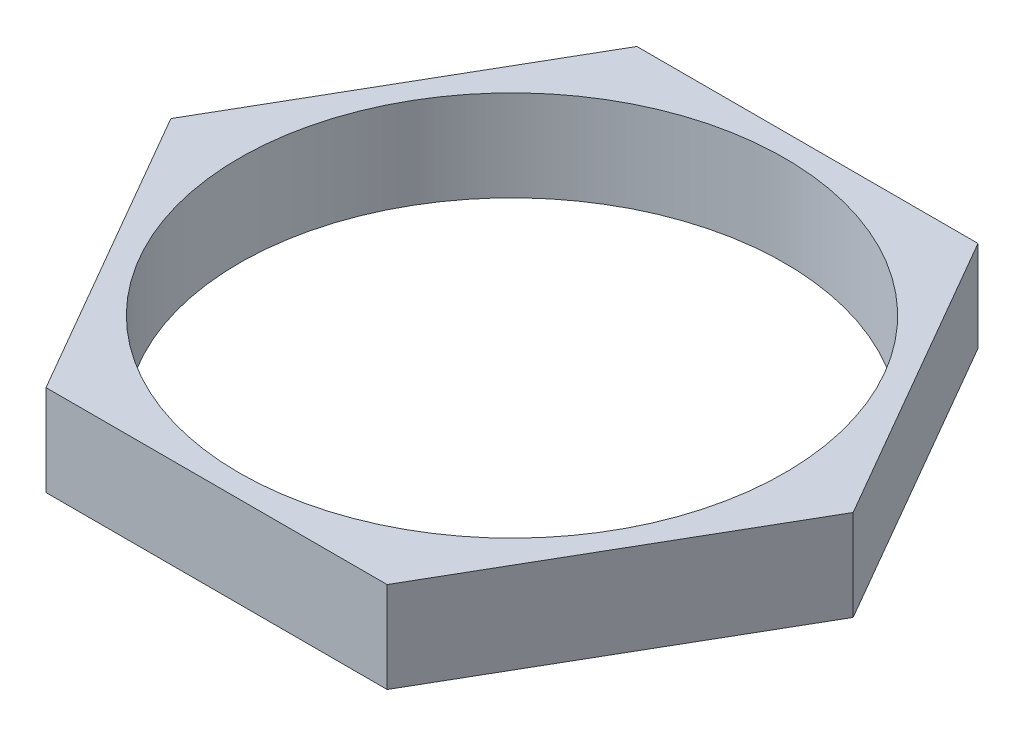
from build123d import *

# Parameters (mm, degrees)
ESQUISSE1_R      = 9
EXTRUSION1_DEPTH = 3


with BuildPart() as part:
    # Esquisse1 → Extrusion1 (new body)
    with BuildSketch(Plane(origin=(0, 0, 0), x_dir=(1, 0, 0), z_dir=(0, 1, 0))):
        Polygon((5.629165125, -9.75), (11.258330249, 0), (5.629165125, 9.75), (-5.629165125, 9.75), (-11.258330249, 0), (-5.629165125, -9.75), align=None)
        with Locations(Location((0, 0, 0), (0, 0, 270))):
            Circle(ESQUISSE1_R, mode=Mode.SUBTRACT)
    extrude(amount=EXTRUSION1_DEPTH)


solid = part.part
